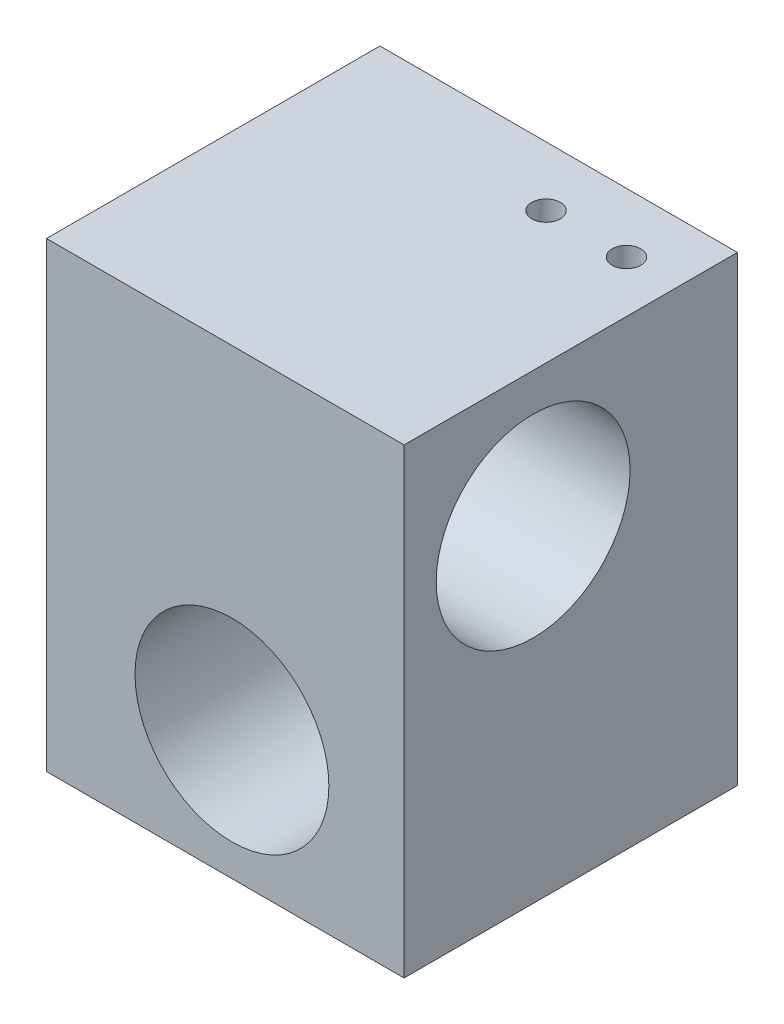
ISO-10303-21;
HEADER;
FILE_DESCRIPTION(('STEP AP214'),'2;1');
FILE_NAME('part.step','',(''),(''),'','','');
FILE_SCHEMA(('AUTOMOTIVE_DESIGN { 1 0 10303 214 1 1 1 1 }'));
ENDSEC;
DATA;
#1=APPLICATION_CONTEXT('core data for automotive mechanical design processes');
#2=APPLICATION_PROTOCOL_DEFINITION('international standard','automotive_design',2000,#1);
#3=PRODUCT_CONTEXT('',#1,'mechanical');
#4=PRODUCT('Part','Part','',(#3));
#5=PRODUCT_RELATED_PRODUCT_CATEGORY('part','',(#4));
#6=PRODUCT_DEFINITION_FORMATION('','',#4);
#7=PRODUCT_DEFINITION_CONTEXT('part definition',#1,'design');
#8=PRODUCT_DEFINITION('design','',#6,#7);
#9=PRODUCT_DEFINITION_SHAPE('','',#8);
#10=(LENGTH_UNIT() NAMED_UNIT(*) SI_UNIT(.MILLI.,.METRE.));
#11=(NAMED_UNIT(*) PLANE_ANGLE_UNIT() SI_UNIT($,.RADIAN.));
#12=(NAMED_UNIT(*) SI_UNIT($,.STERADIAN.) SOLID_ANGLE_UNIT());
#13=UNCERTAINTY_MEASURE_WITH_UNIT(LENGTH_MEASURE(1.E-05),#10,'distance_accuracy_value','');
#14=(GEOMETRIC_REPRESENTATION_CONTEXT(3) GLOBAL_UNCERTAINTY_ASSIGNED_CONTEXT((#13)) GLOBAL_UNIT_ASSIGNED_CONTEXT((#10,
#11,#12)) REPRESENTATION_CONTEXT('',''));
#15=CARTESIAN_POINT('',(0.,0.,0.));
#16=DIRECTION('',(0.,0.,1.));
#17=DIRECTION('',(1.,0.,0.));
#18=AXIS2_PLACEMENT_3D('',#15,#16,#17);
#19=CARTESIAN_POINT('',(14.4800899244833,28.7,8.11139705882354));
#20=DIRECTION('',(-1.,0.,0.));
#21=DIRECTION('',(0.,0.,1.));
#22=AXIS2_PLACEMENT_3D('',#19,#20,#21);
#23=PLANE('',#22);
#24=CARTESIAN_POINT('',(14.4800899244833,20.319,-4.58860294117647));
#25=DIRECTION('',(1.,0.,0.));
#26=DIRECTION('',(0.,0.,-1.));
#27=AXIS2_PLACEMENT_3D('',#24,#25,#26);
#28=CIRCLE('',#27,6.025);
#29=CARTESIAN_POINT('',(14.4800899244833,20.319,-10.6136029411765));
#30=VERTEX_POINT('',#29);
#31=EDGE_CURVE('E140',#30,#30,#28,.T.);
#32=ORIENTED_EDGE('',*,*,#31,.F.);
#33=EDGE_LOOP('',(#32));
#34=FACE_BOUND('',#33,.T.);
#35=DIRECTION('',(0.,0.,-1.));
#36=VECTOR('',#35,1.);
#37=CARTESIAN_POINT('',(14.4800899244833,28.7,8.11139705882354));
#38=LINE('',#37,#36);
#39=CARTESIAN_POINT('',(14.4800899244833,28.7,3.43639705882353));
#40=VERTEX_POINT('',#39);
#41=CARTESIAN_POINT('',(14.4800899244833,28.7,-17.2886029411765));
#42=VERTEX_POINT('',#41);
#43=EDGE_CURVE('E61',#40,#42,#38,.T.);
#44=ORIENTED_EDGE('',*,*,#43,.F.);
#45=DIRECTION('',(0.,1.,0.));
#46=VECTOR('',#45,1.);
#47=CARTESIAN_POINT('',(14.4800899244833,0.,3.43639705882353));
#48=LINE('',#47,#46);
#49=CARTESIAN_POINT('',(14.4800899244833,0.,3.43639705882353));
#50=VERTEX_POINT('',#49);
#51=EDGE_CURVE('E117',#50,#40,#48,.T.);
#52=ORIENTED_EDGE('',*,*,#51,.F.);
#53=DIRECTION('',(0.,0.,-1.));
#54=VECTOR('',#53,1.);
#55=CARTESIAN_POINT('',(14.4800899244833,0.,8.11139705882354));
#56=LINE('',#55,#54);
#57=CARTESIAN_POINT('',(14.4800899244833,0.,-17.2886029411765));
#58=VERTEX_POINT('',#57);
#59=EDGE_CURVE('E146',#50,#58,#56,.T.);
#60=ORIENTED_EDGE('',*,*,#59,.T.);
#61=DIRECTION('',(0.,-1.,0.));
#62=VECTOR('',#61,1.);
#63=CARTESIAN_POINT('',(14.4800899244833,28.7,-17.2886029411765));
#64=LINE('',#63,#62);
#65=EDGE_CURVE('E11',#42,#58,#64,.T.);
#66=ORIENTED_EDGE('',*,*,#65,.F.);
#67=EDGE_LOOP('',(#44,#52,#60,#66));
#68=FACE_BOUND('',#67,.T.);
#69=ADVANCED_FACE('F36',(#34,#68),#23,.F.);
#70=CARTESIAN_POINT('',(-10.9199100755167,28.7,-17.2886029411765));
#71=DIRECTION('',(0.,0.,1.));
#72=DIRECTION('',(1.,0.,0.));
#73=AXIS2_PLACEMENT_3D('',#70,#71,#72);
#74=PLANE('',#73);
#75=CARTESIAN_POINT('',(3.78008992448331,8.,-17.2886029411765));
#76=DIRECTION('',(0.,0.,1.));
#77=DIRECTION('',(1.,0.,0.));
#78=AXIS2_PLACEMENT_3D('',#75,#76,#77);
#79=CIRCLE('',#78,6.0254);
#80=CARTESIAN_POINT('',(9.80548992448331,8.,-17.2886029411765));
#81=VERTEX_POINT('',#80);
#82=EDGE_CURVE('E143',#81,#81,#79,.T.);
#83=ORIENTED_EDGE('',*,*,#82,.T.);
#84=EDGE_LOOP('',(#83));
#85=FACE_BOUND('',#84,.T.);
#86=DIRECTION('',(-1.,0.,0.));
#87=VECTOR('',#86,1.);
#88=CARTESIAN_POINT('',(-10.9199100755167,0.,-17.2886029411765));
#89=LINE('',#88,#87);
#90=CARTESIAN_POINT('',(-7.74491007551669,0.,-17.2886029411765));
#91=VERTEX_POINT('',#90);
#92=EDGE_CURVE('E148',#58,#91,#89,.T.);
#93=ORIENTED_EDGE('',*,*,#92,.T.);
#94=DIRECTION('',(0.,1.,0.));
#95=VECTOR('',#94,1.);
#96=CARTESIAN_POINT('',(-7.74491007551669,0.,-17.2886029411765));
#97=LINE('',#96,#95);
#98=CARTESIAN_POINT('',(-7.74491007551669,28.7,-17.2886029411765));
#99=VERTEX_POINT('',#98);
#100=EDGE_CURVE('E121',#91,#99,#97,.T.);
#101=ORIENTED_EDGE('',*,*,#100,.T.);
#102=DIRECTION('',(-1.,0.,0.));
#103=VECTOR('',#102,1.);
#104=CARTESIAN_POINT('',(-10.9199100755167,28.7,-17.2886029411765));
#105=LINE('',#104,#103);
#106=EDGE_CURVE('E44',#42,#99,#105,.T.);
#107=ORIENTED_EDGE('',*,*,#106,.F.);
#108=ORIENTED_EDGE('',*,*,#65,.T.);
#109=EDGE_LOOP('',(#93,#101,#107,#108));
#110=FACE_BOUND('',#109,.T.);
#111=ADVANCED_FACE('F177',(#85,#110),#74,.F.);
#112=CARTESIAN_POINT('',(0.,28.7,0.));
#113=DIRECTION('',(0.,-1.,0.));
#114=DIRECTION('',(0.,0.,-1.));
#115=AXIS2_PLACEMENT_3D('',#112,#113,#114);
#116=PLANE('',#115);
#117=CARTESIAN_POINT('',(6.28008992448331,28.7,-13.5886029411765));
#118=DIRECTION('',(0.,1.,0.));
#119=DIRECTION('',(0.,0.,1.));
#120=AXIS2_PLACEMENT_3D('',#117,#118,#119);
#121=CIRCLE('',#120,0.888999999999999);
#122=CARTESIAN_POINT('',(6.28008992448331,28.7,-12.6996029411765));
#123=VERTEX_POINT('',#122);
#124=EDGE_CURVE('E128',#123,#123,#121,.T.);
#125=ORIENTED_EDGE('',*,*,#124,.F.);
#126=EDGE_LOOP('',(#125));
#127=FACE_BOUND('',#126,.T.);
#128=CARTESIAN_POINT('',(11.2800899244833,28.7,-13.5886029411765));
#129=DIRECTION('',(0.,1.,0.));
#130=DIRECTION('',(0.,0.,1.));
#131=AXIS2_PLACEMENT_3D('',#128,#129,#130);
#132=CIRCLE('',#131,0.888999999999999);
#133=CARTESIAN_POINT('',(11.2800899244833,28.7,-12.6996029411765));
#134=VERTEX_POINT('',#133);
#135=EDGE_CURVE('E134',#134,#134,#132,.T.);
#136=ORIENTED_EDGE('',*,*,#135,.F.);
#137=EDGE_LOOP('',(#136));
#138=FACE_BOUND('',#137,.T.);
#139=ORIENTED_EDGE('',*,*,#106,.T.);
#140=DIRECTION('',(0.,0.,-1.));
#141=VECTOR('',#140,1.);
#142=CARTESIAN_POINT('',(-7.74491007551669,28.7,-17.2886029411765));
#143=LINE('',#142,#141);
#144=CARTESIAN_POINT('',(-7.74491007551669,28.7,3.43639705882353));
#145=VERTEX_POINT('',#144);
#146=EDGE_CURVE('E115',#145,#99,#143,.T.);
#147=ORIENTED_EDGE('',*,*,#146,.F.);
#148=DIRECTION('',(-1.,0.,0.));
#149=VECTOR('',#148,1.);
#150=CARTESIAN_POINT('',(-7.74491007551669,28.7,3.43639705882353));
#151=LINE('',#150,#149);
#152=EDGE_CURVE('E111',#40,#145,#151,.T.);
#153=ORIENTED_EDGE('',*,*,#152,.F.);
#154=ORIENTED_EDGE('',*,*,#43,.T.);
#155=EDGE_LOOP('',(#139,#147,#153,#154));
#156=FACE_BOUND('',#155,.T.);
#157=ADVANCED_FACE('F182',(#127,#138,#156),#116,.F.);
#158=CARTESIAN_POINT('',(0.,0.,0.));
#159=DIRECTION('',(0.,-1.,0.));
#160=DIRECTION('',(0.,0.,-1.));
#161=AXIS2_PLACEMENT_3D('',#158,#159,#160);
#162=PLANE('',#161);
#163=CARTESIAN_POINT('',(-3.93491007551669,0.,-13.5886029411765));
#164=DIRECTION('',(0.,-1.,0.));
#165=DIRECTION('',(0.,0.,-1.));
#166=AXIS2_PLACEMENT_3D('',#163,#164,#165);
#167=CIRCLE('',#166,0.888999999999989);
#168=CARTESIAN_POINT('',(-3.93491007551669,0.,-14.4776029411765));
#169=VERTEX_POINT('',#168);
#170=EDGE_CURVE('E101',#169,#169,#167,.T.);
#171=ORIENTED_EDGE('',*,*,#170,.F.);
#172=EDGE_LOOP('',(#171));
#173=FACE_BOUND('',#172,.T.);
#174=CARTESIAN_POINT('',(-3.9349100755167,0.,-3.58860294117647));
#175=DIRECTION('',(0.,-1.,0.));
#176=DIRECTION('',(0.,0.,-1.));
#177=AXIS2_PLACEMENT_3D('',#174,#175,#176);
#178=CIRCLE('',#177,0.888999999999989);
#179=CARTESIAN_POINT('',(-3.9349100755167,0.,-4.47760294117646));
#180=VERTEX_POINT('',#179);
#181=EDGE_CURVE('E100',#180,#180,#178,.T.);
#182=ORIENTED_EDGE('',*,*,#181,.F.);
#183=EDGE_LOOP('',(#182));
#184=FACE_BOUND('',#183,.T.);
#185=DIRECTION('',(0.,0.,-1.));
#186=VECTOR('',#185,1.);
#187=CARTESIAN_POINT('',(-7.74491007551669,0.,-17.2886029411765));
#188=LINE('',#187,#186);
#189=CARTESIAN_POINT('',(-7.74491007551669,0.,3.43639705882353));
#190=VERTEX_POINT('',#189);
#191=EDGE_CURVE('E52',#190,#91,#188,.T.);
#192=ORIENTED_EDGE('',*,*,#191,.T.);
#193=ORIENTED_EDGE('',*,*,#92,.F.);
#194=ORIENTED_EDGE('',*,*,#59,.F.);
#195=DIRECTION('',(-1.,0.,0.));
#196=VECTOR('',#195,1.);
#197=CARTESIAN_POINT('',(-7.74491007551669,0.,3.43639705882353));
#198=LINE('',#197,#196);
#199=EDGE_CURVE('E112',#50,#190,#198,.T.);
#200=ORIENTED_EDGE('',*,*,#199,.T.);
#201=EDGE_LOOP('',(#192,#193,#194,#200));
#202=FACE_BOUND('',#201,.T.);
#203=ADVANCED_FACE('F194',(#173,#184,#202),#162,.T.);
#204=CARTESIAN_POINT('',(3.78008992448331,8.,-17.2886029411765));
#205=DIRECTION('',(0.,0.,1.));
#206=DIRECTION('',(1.,0.,0.));
#207=AXIS2_PLACEMENT_3D('',#204,#205,#206);
#208=CYLINDRICAL_SURFACE('',#207,6.0254);
#209=CARTESIAN_POINT('',(3.78008992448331,8.,3.43639705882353));
#210=DIRECTION('',(0.,0.,-1.));
#211=DIRECTION('',(-1.,0.,0.));
#212=AXIS2_PLACEMENT_3D('',#209,#210,#211);
#213=CIRCLE('',#212,6.0254);
#214=CARTESIAN_POINT('',(-2.2453100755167,8.,3.43639705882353));
#215=VERTEX_POINT('',#214);
#216=EDGE_CURVE('E39',#215,#215,#213,.F.);
#217=ORIENTED_EDGE('',*,*,#216,.T.);
#218=EDGE_LOOP('',(#217));
#219=FACE_BOUND('',#218,.T.);
#220=ORIENTED_EDGE('',*,*,#82,.F.);
#221=EDGE_LOOP('',(#220));
#222=FACE_BOUND('',#221,.T.);
#223=ADVANCED_FACE('F158',(#219,#222),#208,.F.);
#224=CARTESIAN_POINT('',(-10.9199100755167,20.319,-4.58860294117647));
#225=DIRECTION('',(1.,0.,0.));
#226=DIRECTION('',(0.,0.,-1.));
#227=AXIS2_PLACEMENT_3D('',#224,#225,#226);
#228=CYLINDRICAL_SURFACE('',#227,6.025);
#229=CARTESIAN_POINT('',(-7.74491007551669,20.319,-4.58860294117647));
#230=DIRECTION('',(1.,0.,0.));
#231=DIRECTION('',(0.,0.,-1.));
#232=AXIS2_PLACEMENT_3D('',#229,#230,#231);
#233=CIRCLE('',#232,6.025);
#234=CARTESIAN_POINT('',(-7.74491007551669,20.319,-10.6136029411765));
#235=VERTEX_POINT('',#234);
#236=EDGE_CURVE('E124',#235,#235,#233,.F.);
#237=ORIENTED_EDGE('',*,*,#236,.T.);
#238=EDGE_LOOP('',(#237));
#239=FACE_BOUND('',#238,.T.);
#240=ORIENTED_EDGE('',*,*,#31,.T.);
#241=EDGE_LOOP('',(#240));
#242=FACE_BOUND('',#241,.T.);
#243=ADVANCED_FACE('F202',(#239,#242),#228,.F.);
#244=CARTESIAN_POINT('',(11.2800899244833,22.0452,-13.5886029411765));
#245=DIRECTION('',(0.,1.,0.));
#246=DIRECTION('',(0.,0.,1.));
#247=AXIS2_PLACEMENT_3D('',#244,#245,#246);
#248=CONICAL_SURFACE('',#247,0.888999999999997,1.02974425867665);
#249=CARTESIAN_POINT('',(11.2800899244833,21.5110349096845,-13.5886029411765));
#250=VERTEX_POINT('',#249);
#251=VERTEX_LOOP('',#250);
#252=FACE_BOUND('',#251,.T.);
#253=CARTESIAN_POINT('',(11.2800899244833,22.0452,-13.5886029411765));
#254=DIRECTION('',(0.,1.,0.));
#255=DIRECTION('',(0.,0.,1.));
#256=AXIS2_PLACEMENT_3D('',#253,#254,#255);
#257=CIRCLE('',#256,0.888999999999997);
#258=CARTESIAN_POINT('',(11.2800899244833,22.0452,-12.6996029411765));
#259=VERTEX_POINT('',#258);
#260=EDGE_CURVE('E137',#259,#259,#257,.T.);
#261=ORIENTED_EDGE('',*,*,#260,.T.);
#262=EDGE_LOOP('',(#261));
#263=FACE_BOUND('',#262,.T.);
#264=ADVANCED_FACE('F211',(#252,#263),#248,.F.);
#265=CARTESIAN_POINT('',(11.2800899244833,28.7,-13.5886029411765));
#266=DIRECTION('',(0.,1.,0.));
#267=DIRECTION('',(0.,0.,1.));
#268=AXIS2_PLACEMENT_3D('',#265,#266,#267);
#269=CYLINDRICAL_SURFACE('',#268,0.888999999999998);
#270=ORIENTED_EDGE('',*,*,#260,.F.);
#271=EDGE_LOOP('',(#270));
#272=FACE_BOUND('',#271,.T.);
#273=ORIENTED_EDGE('',*,*,#135,.T.);
#274=EDGE_LOOP('',(#273));
#275=FACE_BOUND('',#274,.T.);
#276=ADVANCED_FACE('F214',(#272,#275),#269,.F.);
#277=CARTESIAN_POINT('',(6.28008992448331,22.0452,-13.5886029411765));
#278=DIRECTION('',(0.,1.,0.));
#279=DIRECTION('',(0.,0.,1.));
#280=AXIS2_PLACEMENT_3D('',#277,#278,#279);
#281=CONICAL_SURFACE('',#280,0.888999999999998,1.02974425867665);
#282=CARTESIAN_POINT('',(6.28008992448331,21.5110349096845,-13.5886029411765));
#283=VERTEX_POINT('',#282);
#284=VERTEX_LOOP('',#283);
#285=FACE_BOUND('',#284,.T.);
#286=CARTESIAN_POINT('',(6.28008992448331,22.0452,-13.5886029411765));
#287=DIRECTION('',(0.,1.,0.));
#288=DIRECTION('',(0.,0.,1.));
#289=AXIS2_PLACEMENT_3D('',#286,#287,#288);
#290=CIRCLE('',#289,0.888999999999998);
#291=CARTESIAN_POINT('',(6.28008992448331,22.0452,-12.6996029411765));
#292=VERTEX_POINT('',#291);
#293=EDGE_CURVE('E131',#292,#292,#290,.T.);
#294=ORIENTED_EDGE('',*,*,#293,.T.);
#295=EDGE_LOOP('',(#294));
#296=FACE_BOUND('',#295,.T.);
#297=ADVANCED_FACE('F173',(#285,#296),#281,.F.);
#298=CARTESIAN_POINT('',(6.28008992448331,28.7,-13.5886029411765));
#299=DIRECTION('',(0.,1.,0.));
#300=DIRECTION('',(0.,0.,1.));
#301=AXIS2_PLACEMENT_3D('',#298,#299,#300);
#302=CYLINDRICAL_SURFACE('',#301,0.888999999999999);
#303=ORIENTED_EDGE('',*,*,#293,.F.);
#304=EDGE_LOOP('',(#303));
#305=FACE_BOUND('',#304,.T.);
#306=ORIENTED_EDGE('',*,*,#124,.T.);
#307=EDGE_LOOP('',(#306));
#308=FACE_BOUND('',#307,.T.);
#309=ADVANCED_FACE('F164',(#305,#308),#302,.F.);
#310=CARTESIAN_POINT('',(-7.74491007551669,0.,3.43639705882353));
#311=DIRECTION('',(0.,0.,-1.));
#312=DIRECTION('',(-1.,0.,0.));
#313=AXIS2_PLACEMENT_3D('',#310,#311,#312);
#314=PLANE('',#313);
#315=ORIENTED_EDGE('',*,*,#152,.T.);
#316=DIRECTION('',(0.,1.,0.));
#317=VECTOR('',#316,1.);
#318=CARTESIAN_POINT('',(-7.74491007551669,0.,3.43639705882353));
#319=LINE('',#318,#317);
#320=EDGE_CURVE('E125',#190,#145,#319,.T.);
#321=ORIENTED_EDGE('',*,*,#320,.F.);
#322=ORIENTED_EDGE('',*,*,#199,.F.);
#323=ORIENTED_EDGE('',*,*,#51,.T.);
#324=EDGE_LOOP('',(#315,#321,#322,#323));
#325=FACE_BOUND('',#324,.T.);
#326=ORIENTED_EDGE('',*,*,#216,.F.);
#327=EDGE_LOOP('',(#326));
#328=FACE_BOUND('',#327,.T.);
#329=ADVANCED_FACE('F161',(#325,#328),#314,.F.);
#330=CARTESIAN_POINT('',(-7.74491007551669,0.,-17.2886029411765));
#331=DIRECTION('',(1.,0.,0.));
#332=DIRECTION('',(0.,0.,-1.));
#333=AXIS2_PLACEMENT_3D('',#330,#331,#332);
#334=PLANE('',#333);
#335=ORIENTED_EDGE('',*,*,#146,.T.);
#336=ORIENTED_EDGE('',*,*,#100,.F.);
#337=ORIENTED_EDGE('',*,*,#191,.F.);
#338=ORIENTED_EDGE('',*,*,#320,.T.);
#339=EDGE_LOOP('',(#335,#336,#337,#338));
#340=FACE_BOUND('',#339,.T.);
#341=ORIENTED_EDGE('',*,*,#236,.F.);
#342=EDGE_LOOP('',(#341));
#343=FACE_BOUND('',#342,.T.);
#344=ADVANCED_FACE('F163',(#340,#343),#334,.F.);
#345=CARTESIAN_POINT('',(-3.9349100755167,6.6548,-3.58860294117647));
#346=DIRECTION('',(0.,-1.,0.));
#347=DIRECTION('',(0.,0.,-1.));
#348=AXIS2_PLACEMENT_3D('',#345,#346,#347);
#349=CONICAL_SURFACE('',#348,0.888999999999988,1.02974425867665);
#350=CARTESIAN_POINT('',(-3.9349100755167,7.1889650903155,-3.58860294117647));
#351=VERTEX_POINT('',#350);
#352=VERTEX_LOOP('',#351);
#353=FACE_BOUND('',#352,.T.);
#354=CARTESIAN_POINT('',(-3.9349100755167,6.6548,-3.58860294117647));
#355=DIRECTION('',(0.,-1.,0.));
#356=DIRECTION('',(0.,0.,-1.));
#357=AXIS2_PLACEMENT_3D('',#354,#355,#356);
#358=CIRCLE('',#357,0.888999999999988);
#359=CARTESIAN_POINT('',(-3.9349100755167,6.6548,-4.47760294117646));
#360=VERTEX_POINT('',#359);
#361=EDGE_CURVE('E104',#360,#360,#358,.T.);
#362=ORIENTED_EDGE('',*,*,#361,.T.);
#363=EDGE_LOOP('',(#362));
#364=FACE_BOUND('',#363,.T.);
#365=ADVANCED_FACE('F171',(#353,#364),#349,.F.);
#366=CARTESIAN_POINT('',(-3.9349100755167,0.,-3.58860294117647));
#367=DIRECTION('',(0.,-1.,0.));
#368=DIRECTION('',(0.,0.,-1.));
#369=AXIS2_PLACEMENT_3D('',#366,#367,#368);
#370=CYLINDRICAL_SURFACE('',#369,0.888999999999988);
#371=ORIENTED_EDGE('',*,*,#361,.F.);
#372=EDGE_LOOP('',(#371));
#373=FACE_BOUND('',#372,.T.);
#374=ORIENTED_EDGE('',*,*,#181,.T.);
#375=EDGE_LOOP('',(#374));
#376=FACE_BOUND('',#375,.T.);
#377=ADVANCED_FACE('F94',(#373,#376),#370,.F.);
#378=CARTESIAN_POINT('',(-3.93491007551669,6.6548,-13.5886029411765));
#379=DIRECTION('',(0.,-1.,0.));
#380=DIRECTION('',(0.,0.,-1.));
#381=AXIS2_PLACEMENT_3D('',#378,#379,#380);
#382=CONICAL_SURFACE('',#381,0.888999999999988,1.02974425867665);
#383=CARTESIAN_POINT('',(-3.9349100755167,7.1889650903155,-13.5886029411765));
#384=VERTEX_POINT('',#383);
#385=VERTEX_LOOP('',#384);
#386=FACE_BOUND('',#385,.T.);
#387=CARTESIAN_POINT('',(-3.93491007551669,6.6548,-13.5886029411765));
#388=DIRECTION('',(0.,-1.,0.));
#389=DIRECTION('',(0.,0.,-1.));
#390=AXIS2_PLACEMENT_3D('',#387,#388,#389);
#391=CIRCLE('',#390,0.888999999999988);
#392=CARTESIAN_POINT('',(-3.93491007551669,6.6548,-14.4776029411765));
#393=VERTEX_POINT('',#392);
#394=EDGE_CURVE('E98',#393,#393,#391,.T.);
#395=ORIENTED_EDGE('',*,*,#394,.T.);
#396=EDGE_LOOP('',(#395));
#397=FACE_BOUND('',#396,.T.);
#398=ADVANCED_FACE('F90',(#386,#397),#382,.F.);
#399=CARTESIAN_POINT('',(-3.93491007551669,0.,-13.5886029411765));
#400=DIRECTION('',(0.,-1.,0.));
#401=DIRECTION('',(0.,0.,-1.));
#402=AXIS2_PLACEMENT_3D('',#399,#400,#401);
#403=CYLINDRICAL_SURFACE('',#402,0.888999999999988);
#404=ORIENTED_EDGE('',*,*,#394,.F.);
#405=EDGE_LOOP('',(#404));
#406=FACE_BOUND('',#405,.T.);
#407=ORIENTED_EDGE('',*,*,#170,.T.);
#408=EDGE_LOOP('',(#407));
#409=FACE_BOUND('',#408,.T.);
#410=ADVANCED_FACE('F93',(#406,#409),#403,.F.);
#411=CLOSED_SHELL('',(#69,#111,#157,#203,#223,#243,#264,#276,#297,#309,#329,#344,#365,#377,#398,#410));
#412=MANIFOLD_SOLID_BREP('B2',#411);
#413=ADVANCED_BREP_SHAPE_REPRESENTATION('',(#18,#412),#14);
#414=SHAPE_DEFINITION_REPRESENTATION(#9,#413);
ENDSEC;
END-ISO-10303-21;
